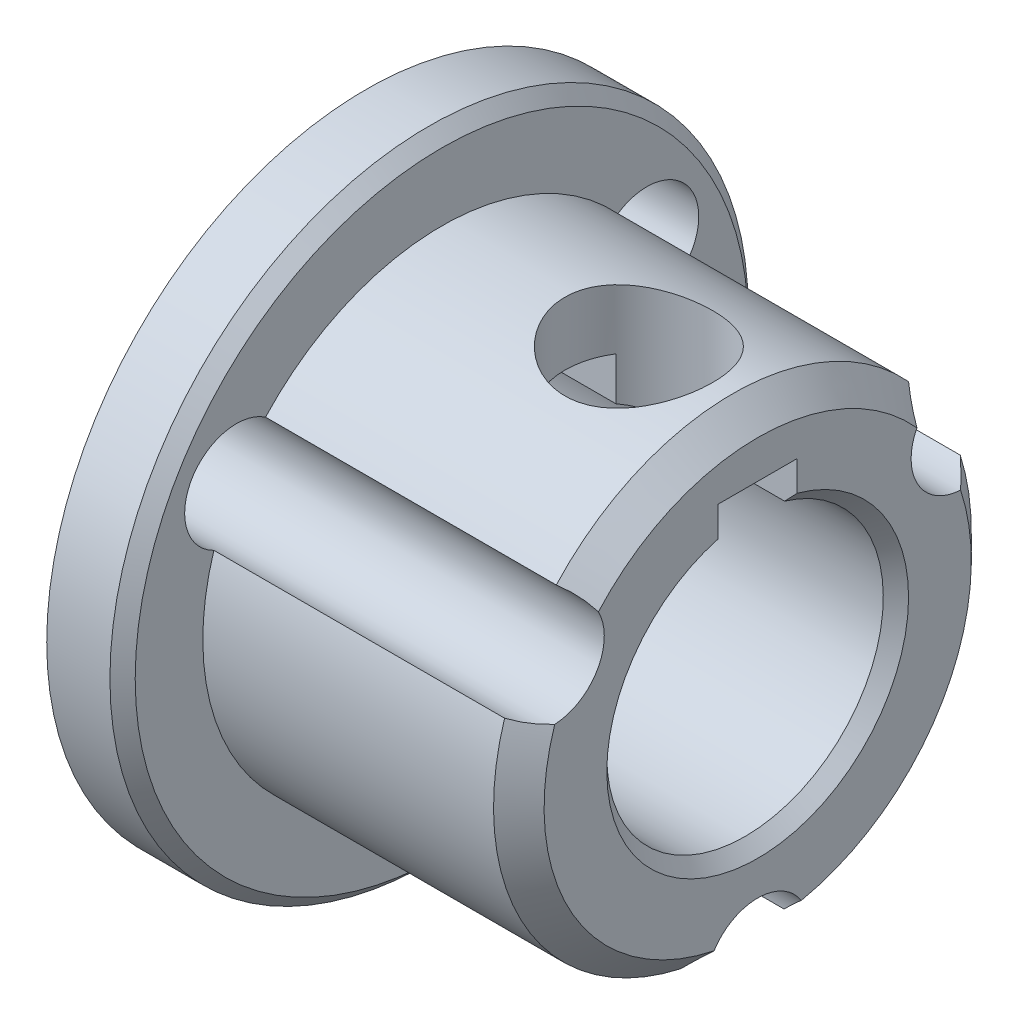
ISO-10303-21;
HEADER;
FILE_DESCRIPTION(('STEP AP214'),'2;1');
FILE_NAME('part.step','',(''),(''),'','','');
FILE_SCHEMA(('AUTOMOTIVE_DESIGN { 1 0 10303 214 1 1 1 1 }'));
ENDSEC;
DATA;
#1=APPLICATION_CONTEXT('core data for automotive mechanical design processes');
#2=APPLICATION_PROTOCOL_DEFINITION('international standard','automotive_design',2000,#1);
#3=PRODUCT_CONTEXT('',#1,'mechanical');
#4=PRODUCT('Part','Part','',(#3));
#5=PRODUCT_RELATED_PRODUCT_CATEGORY('part','',(#4));
#6=PRODUCT_DEFINITION_FORMATION('','',#4);
#7=PRODUCT_DEFINITION_CONTEXT('part definition',#1,'design');
#8=PRODUCT_DEFINITION('design','',#6,#7);
#9=PRODUCT_DEFINITION_SHAPE('','',#8);
#10=(LENGTH_UNIT() NAMED_UNIT(*) SI_UNIT(.MILLI.,.METRE.));
#11=(NAMED_UNIT(*) PLANE_ANGLE_UNIT() SI_UNIT($,.RADIAN.));
#12=(NAMED_UNIT(*) SI_UNIT($,.STERADIAN.) SOLID_ANGLE_UNIT());
#13=UNCERTAINTY_MEASURE_WITH_UNIT(LENGTH_MEASURE(1.E-05),#10,'distance_accuracy_value','');
#14=(GEOMETRIC_REPRESENTATION_CONTEXT(3) GLOBAL_UNCERTAINTY_ASSIGNED_CONTEXT((#13)) GLOBAL_UNIT_ASSIGNED_CONTEXT((#10,
#11,#12)) REPRESENTATION_CONTEXT('',''));
#15=CARTESIAN_POINT('',(0.,0.,0.));
#16=DIRECTION('',(0.,0.,1.));
#17=DIRECTION('',(1.,0.,0.));
#18=AXIS2_PLACEMENT_3D('',#15,#16,#17);
#19=CARTESIAN_POINT('',(0.,0.,0.));
#20=DIRECTION('',(-1.,0.,0.));
#21=DIRECTION('',(0.,0.,1.));
#22=AXIS2_PLACEMENT_3D('',#19,#20,#21);
#23=CYLINDRICAL_SURFACE('',#22,9.6012);
#24=CARTESIAN_POINT('',(7.92480000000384,9.12970132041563,-2.97180000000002));
#25=CARTESIAN_POINT('',(7.76222361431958,9.12970249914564,-2.97179866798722));
#26=CARTESIAN_POINT('',(7.59963390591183,9.13409143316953,-2.95841374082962));
#27=CARTESIAN_POINT('',(7.27922554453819,9.15109716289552,-2.90537716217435));
#28=CARTESIAN_POINT('',(7.12140826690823,9.16371630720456,-2.86571801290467));
#29=CARTESIAN_POINT('',(6.8152315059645,9.19561923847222,-2.7616227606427));
#30=CARTESIAN_POINT('',(6.66685605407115,9.21489139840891,-2.69722986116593));
#31=CARTESIAN_POINT('',(6.38297414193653,9.25791282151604,-2.54563862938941));
#32=CARTESIAN_POINT('',(6.24746987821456,9.28166284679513,-2.45843641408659));
#33=CARTESIAN_POINT('',(5.98861063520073,9.33186158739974,-2.26055519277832));
#34=CARTESIAN_POINT('',(5.86575327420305,9.35837058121,-2.14924036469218));
#35=CARTESIAN_POINT('',(5.640117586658,9.41058697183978,-1.90765476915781));
#36=CARTESIAN_POINT('',(5.53734200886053,9.43629425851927,-1.77738141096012));
#37=CARTESIAN_POINT('',(5.35259990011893,9.48469906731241,-1.49800948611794));
#38=CARTESIAN_POINT('',(5.27114460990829,9.5073173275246,-1.34855790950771));
#39=CARTESIAN_POINT('',(5.1347190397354,9.54629257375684,-1.03725757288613));
#40=CARTESIAN_POINT('',(5.0797426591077,9.56265100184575,-0.875411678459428));
#41=CARTESIAN_POINT('',(4.99949343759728,9.58683680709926,-0.5491261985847));
#42=CARTESIAN_POINT('',(4.9733703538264,9.59490785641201,-0.384914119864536));
#43=CARTESIAN_POINT('',(4.94887665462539,9.60246952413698,-0.0542526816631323));
#44=CARTESIAN_POINT('',(4.95049984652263,9.60196205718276,0.112196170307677));
#45=CARTESIAN_POINT('',(4.98089054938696,9.5925941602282,0.436626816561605));
#46=CARTESIAN_POINT('',(5.00873659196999,9.5840172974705,0.594704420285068));
#47=CARTESIAN_POINT('',(5.08927221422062,9.55982207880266,0.903821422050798));
#48=CARTESIAN_POINT('',(5.14196340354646,9.54420326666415,1.05486036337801));
#49=CARTESIAN_POINT('',(5.27129332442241,9.50729569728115,1.34775418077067));
#50=CARTESIAN_POINT('',(5.34821413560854,9.48594061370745,1.48947579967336));
#51=CARTESIAN_POINT('',(5.52359428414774,9.43981416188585,1.75828834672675));
#52=CARTESIAN_POINT('',(5.62205898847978,9.41504194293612,1.88537561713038));
#53=CARTESIAN_POINT('',(5.84247446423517,9.36352500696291,2.12680769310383));
#54=CARTESIAN_POINT('',(5.96522143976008,9.33674105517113,2.24041823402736));
#55=CARTESIAN_POINT('',(6.22827854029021,9.28509698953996,2.44565833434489));
#56=CARTESIAN_POINT('',(6.36859065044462,9.26023709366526,2.53728540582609));
#57=CARTESIAN_POINT('',(6.66483543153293,9.21506043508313,2.69679029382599));
#58=CARTESIAN_POINT('',(6.8209202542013,9.19479556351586,2.76440130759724));
#59=CARTESIAN_POINT('',(7.14303702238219,9.16171372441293,2.87215193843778));
#60=CARTESIAN_POINT('',(7.30906545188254,9.14889414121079,2.91230120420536));
#61=CARTESIAN_POINT('',(7.63933285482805,9.13273338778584,2.96258274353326));
#62=CARTESIAN_POINT('',(7.80338372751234,9.12903801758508,2.97383742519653));
#63=CARTESIAN_POINT('',(8.13103959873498,9.13056164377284,2.96915727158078));
#64=CARTESIAN_POINT('',(8.29464466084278,9.13577929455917,2.95322654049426));
#65=CARTESIAN_POINT('',(8.61196912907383,9.15419186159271,2.89563003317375));
#66=CARTESIAN_POINT('',(8.76583720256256,9.16715770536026,2.85470253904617));
#67=CARTESIAN_POINT('',(9.06450677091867,9.19936432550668,2.74913848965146));
#68=CARTESIAN_POINT('',(9.20930680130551,9.21860611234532,2.68449811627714));
#69=CARTESIAN_POINT('',(9.49025461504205,9.26187138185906,2.53125886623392));
#70=CARTESIAN_POINT('',(9.62604256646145,9.28601455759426,2.44203493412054));
#71=CARTESIAN_POINT('',(9.88112787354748,9.33611223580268,2.24289403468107));
#72=CARTESIAN_POINT('',(10.0004210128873,9.36206719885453,2.13297179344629));
#73=CARTESIAN_POINT('',(10.2241180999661,9.4141373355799,1.89025215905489));
#74=CARTESIAN_POINT('',(10.3277223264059,9.44021634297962,1.75670803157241));
#75=CARTESIAN_POINT('',(10.5110790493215,9.48854260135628,1.47350103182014));
#76=CARTESIAN_POINT('',(10.5908326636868,9.51079003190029,1.3238389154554));
#77=CARTESIAN_POINT('',(10.7234572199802,9.54881700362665,1.0135842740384));
#78=CARTESIAN_POINT('',(10.7765245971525,9.56464363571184,0.853081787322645));
#79=CARTESIAN_POINT('',(10.8547421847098,9.58825315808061,0.524855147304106));
#80=CARTESIAN_POINT('',(10.8799009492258,9.59603851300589,0.3571332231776));
#81=CARTESIAN_POINT('',(10.9009028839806,9.6025281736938,0.026597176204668));
#82=CARTESIAN_POINT('',(10.8979022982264,9.60159066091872,-0.136137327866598));
#83=CARTESIAN_POINT('',(10.8654590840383,9.59159454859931,-0.458679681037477));
#84=CARTESIAN_POINT('',(10.8360181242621,9.58253646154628,-0.618487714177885));
#85=CARTESIAN_POINT('',(10.7522612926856,9.55742763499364,-0.928749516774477));
#86=CARTESIAN_POINT('',(10.6982499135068,9.54146260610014,-1.07929290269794));
#87=CARTESIAN_POINT('',(10.5671597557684,9.50418726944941,-1.36925495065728));
#88=CARTESIAN_POINT('',(10.490077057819,9.48287605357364,-1.50867171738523));
#89=CARTESIAN_POINT('',(10.3120469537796,9.43624844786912,-1.77749855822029));
#90=CARTESIAN_POINT('',(10.210387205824,9.41082188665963,-1.90641758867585));
#91=CARTESIAN_POINT('',(9.9873514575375,9.35915666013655,-2.14575110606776));
#92=CARTESIAN_POINT('',(9.86596961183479,9.33291775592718,-2.25616008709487));
#93=CARTESIAN_POINT('',(9.60223165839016,9.2815939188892,-2.45893623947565));
#94=CARTESIAN_POINT('',(9.45932446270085,9.25657368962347,-2.55060498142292));
#95=CARTESIAN_POINT('',(9.15938582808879,9.21160858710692,-2.7085212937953));
#96=CARTESIAN_POINT('',(9.0023604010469,9.19166156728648,-2.77477962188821));
#97=CARTESIAN_POINT('',(8.69330031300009,9.16081814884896,-2.87488209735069));
#98=CARTESIAN_POINT('',(8.54210481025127,9.14926494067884,-2.91112118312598));
#99=CARTESIAN_POINT('',(8.23554293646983,9.13370684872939,-2.9595779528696));
#100=CARTESIAN_POINT('',(8.08017755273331,9.12970019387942,-2.97180127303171));
#101=CARTESIAN_POINT('',(7.92480000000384,9.12970132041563,-2.97180000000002));
#102=B_SPLINE_CURVE_WITH_KNOTS('',3,(#24,#25,#26,#27,#28,#29,#30,#31,#32,#33,#34,#35,#36,#37,
#38,#39,#40,#41,#42,#43,#44,#45,#46,#47,#48,#49,#50,#51,#52,#53,#54,#55,#56,#57,#58,#59,#60,#61,
#62,#63,#64,#65,#66,#67,#68,#69,#70,#71,#72,#73,#74,#75,#76,#77,#78,#79,#80,#81,#82,#83,#84,#85,
#86,#87,#88,#89,#90,#91,#92,#93,#94,#95,#96,#97,#98,#99,#100,#101),.UNSPECIFIED.,.T.,.F.,(4,2,2,
2,2,2,2,2,2,2,2,2,2,2,2,2,2,2,2,2,2,2,2,2,2,2,2,2,2,2,2,2,2,2,2,2,2,2,4),(0.,0.487155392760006,
0.974449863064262,1.46089699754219,1.94742699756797,2.4488202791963,2.95028214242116,
3.46284933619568,3.97529837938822,4.47220663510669,4.96900398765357,5.44897065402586,
5.92896842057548,6.41477477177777,6.90070228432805,7.40651483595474,7.91238460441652,
8.42371036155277,8.93485637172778,9.42582392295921,9.91671735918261,10.393769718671,
10.8708989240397,11.3615026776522,11.8522316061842,12.3628558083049,12.8734560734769,
13.3802407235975,13.8868699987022,14.3727907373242,14.8586808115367,15.3387068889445,
15.8188145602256,16.3149899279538,16.8113126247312,17.3236762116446,17.835822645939,
18.301516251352,18.7671005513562),.UNSPECIFIED.);
#103=CARTESIAN_POINT('',(7.92480000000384,9.12970132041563,-2.97180000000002));
#104=VERTEX_POINT('',#103);
#105=EDGE_CURVE('E236',#104,#104,#102,.T.);
#106=ORIENTED_EDGE('',*,*,#105,.F.);
#107=EDGE_LOOP('',(#106));
#108=FACE_BOUND('',#107,.T.);
#109=CARTESIAN_POINT('',(0.,0.,0.));
#110=DIRECTION('',(-1.,0.,0.));
#111=DIRECTION('',(0.,0.,1.));
#112=AXIS2_PLACEMENT_3D('',#109,#110,#111);
#113=CIRCLE('',#112,9.6012);
#114=CARTESIAN_POINT('',(0.,6.48589029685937,7.07928446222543));
#115=VERTEX_POINT('',#114);
#116=CARTESIAN_POINT('',(8.88178419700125E-13,6.48589029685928,-7.0792844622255));
#117=VERTEX_POINT('',#116);
#118=EDGE_CURVE('E289',#115,#117,#113,.T.);
#119=ORIENTED_EDGE('',*,*,#118,.F.);
#120=DIRECTION('',(-1.,0.,0.));
#121=VECTOR('',#120,1.);
#122=CARTESIAN_POINT('',(4.82600000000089,6.48589029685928,7.07928446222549));
#123=LINE('',#122,#121);
#124=CARTESIAN_POINT('',(11.683999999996,6.48589029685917,7.07928446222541));
#125=VERTEX_POINT('',#124);
#126=EDGE_CURVE('E467',#115,#125,#123,.F.);
#127=ORIENTED_EDGE('',*,*,#126,.T.);
#128=CARTESIAN_POINT('',(11.684,0.,0.));
#129=DIRECTION('',(-1.,0.,0.));
#130=DIRECTION('',(0.,0.,1.));
#131=AXIS2_PLACEMENT_3D('',#128,#129,#130);
#132=CIRCLE('',#131,9.6012);
#133=CARTESIAN_POINT('',(11.684,6.48589029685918,-7.07928446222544));
#134=VERTEX_POINT('',#133);
#135=EDGE_CURVE('E61',#125,#134,#132,.T.);
#136=ORIENTED_EDGE('',*,*,#135,.T.);
#137=DIRECTION('',(-1.,0.,0.));
#138=VECTOR('',#137,1.);
#139=CARTESIAN_POINT('',(4.825999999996,6.48589029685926,-7.07928446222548));
#140=LINE('',#139,#138);
#141=EDGE_CURVE('E463',#134,#117,#140,.T.);
#142=ORIENTED_EDGE('',*,*,#141,.T.);
#143=EDGE_LOOP('',(#119,#127,#136,#142));
#144=FACE_BOUND('',#143,.T.);
#145=ADVANCED_FACE('F32',(#108,#144),#23,.T.);
#146=CARTESIAN_POINT('',(11.684,0.,0.));
#147=DIRECTION('',(-1.,0.,0.));
#148=DIRECTION('',(0.,0.,1.));
#149=AXIS2_PLACEMENT_3D('',#146,#147,#148);
#150=CONICAL_SURFACE('',#149,9.6012,0.785398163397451);
#151=CARTESIAN_POINT('',(12.7001999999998,5.72186332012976,6.40019571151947));
#152=CARTESIAN_POINT('',(12.6173534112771,5.80045367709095,6.44102688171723));
#153=CARTESIAN_POINT('',(12.5334264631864,5.87552135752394,6.48629780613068));
#154=CARTESIAN_POINT('',(12.364889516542,6.01784907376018,6.584673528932));
#155=CARTESIAN_POINT('',(12.2802898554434,6.08516511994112,6.63771488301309));
#156=CARTESIAN_POINT('',(12.1105821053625,6.21244659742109,6.75123525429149));
#157=CARTESIAN_POINT('',(12.0254740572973,6.27241261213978,6.81171368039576));
#158=CARTESIAN_POINT('',(11.8547144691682,6.38501480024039,6.94014201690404));
#159=CARTESIAN_POINT('',(11.7690638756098,6.43759007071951,7.00814658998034));
#160=CARTESIAN_POINT('',(11.6837999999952,6.48600379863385,7.07945172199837));
#161=B_SPLINE_CURVE_WITH_KNOTS('',3,(#151,#152,#153,#154,#155,#156,#157,#158,#159,#160),
.UNSPECIFIED.,.F.,.F.,(4,2,2,2,4),(0.,0.36360895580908,0.724399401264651,1.08516118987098,
1.44874049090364),.UNSPECIFIED.);
#162=CARTESIAN_POINT('',(12.7000000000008,5.72205317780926,6.40029424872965));
#163=VERTEX_POINT('',#162);
#164=EDGE_CURVE('E11',#163,#125,#161,.T.);
#165=ORIENTED_EDGE('',*,*,#164,.F.);
#166=CARTESIAN_POINT('',(12.6999999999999,0.,0.));
#167=DIRECTION('',(-1.,0.,0.));
#168=DIRECTION('',(0.,0.,1.));
#169=AXIS2_PLACEMENT_3D('',#166,#167,#168);
#170=CIRCLE('',#169,8.5852);
#171=CARTESIAN_POINT('',(12.6999999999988,5.7220531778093,-6.40029424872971));
#172=VERTEX_POINT('',#171);
#173=EDGE_CURVE('E181',#172,#163,#170,.F.);
#174=ORIENTED_EDGE('',*,*,#173,.F.);
#175=CARTESIAN_POINT('',(11.6838000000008,6.48600379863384,-7.07945172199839));
#176=CARTESIAN_POINT('',(11.7690638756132,6.4375900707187,-7.00814658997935));
#177=CARTESIAN_POINT('',(11.8547144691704,6.38501480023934,-6.94014201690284));
#178=CARTESIAN_POINT('',(12.025474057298,6.27241261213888,-6.81171368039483));
#179=CARTESIAN_POINT('',(12.1105821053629,6.21244659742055,-6.75123525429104));
#180=CARTESIAN_POINT('',(12.2802898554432,6.08516511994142,-6.63771488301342));
#181=CARTESIAN_POINT('',(12.3648895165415,6.01784907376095,-6.58467352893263));
#182=CARTESIAN_POINT('',(12.5334264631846,5.87552135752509,-6.48629780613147));
#183=CARTESIAN_POINT('',(12.6173534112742,5.80045367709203,-6.44102688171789));
#184=CARTESIAN_POINT('',(12.7001999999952,5.72186332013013,-6.40019571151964));
#185=B_SPLINE_CURVE_WITH_KNOTS('',3,(#175,#176,#177,#178,#179,#180,#181,#182,#183,#184),
.UNSPECIFIED.,.F.,.F.,(4,2,2,2,4),(0.,0.363579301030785,0.724341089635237,1.08513153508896,
1.4487404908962),.UNSPECIFIED.);
#186=EDGE_CURVE('E489',#134,#172,#185,.T.);
#187=ORIENTED_EDGE('',*,*,#186,.F.);
#188=ORIENTED_EDGE('',*,*,#135,.F.);
#189=EDGE_LOOP('',(#165,#174,#187,#188));
#190=FACE_BOUND('',#189,.T.);
#191=ADVANCED_FACE('F179',(#190),#150,.T.);
#192=CARTESIAN_POINT('',(-4.88498130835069E-12,2.88789503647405,-9.15658799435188));
#193=VERTEX_POINT('',#192);
#194=CARTESIAN_POINT('',(-4.88498130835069E-12,-9.37378533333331,-2.07730353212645));
#195=VERTEX_POINT('',#194);
#196=EDGE_CURVE('E280',#193,#195,#113,.T.);
#197=ORIENTED_EDGE('',*,*,#196,.F.);
#198=DIRECTION('',(-1.,0.,0.));
#199=VECTOR('',#198,1.);
#200=CARTESIAN_POINT('',(4.826,2.88789503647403,-9.15658799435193));
#201=LINE('',#200,#199);
#202=CARTESIAN_POINT('',(11.683999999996,2.88789503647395,-9.15658799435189));
#203=VERTEX_POINT('',#202);
#204=EDGE_CURVE('E281',#193,#203,#201,.F.);
#205=ORIENTED_EDGE('',*,*,#204,.T.);
#206=CARTESIAN_POINT('',(11.683999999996,-9.37378533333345,-2.07730353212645));
#207=VERTEX_POINT('',#206);
#208=EDGE_CURVE('E500',#203,#207,#132,.T.);
#209=ORIENTED_EDGE('',*,*,#208,.T.);
#210=DIRECTION('',(-1.,0.,0.));
#211=VECTOR('',#210,1.);
#212=CARTESIAN_POINT('',(4.825999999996,-9.37378533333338,-2.07730353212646));
#213=LINE('',#212,#211);
#214=EDGE_CURVE('E284',#207,#195,#213,.T.);
#215=ORIENTED_EDGE('',*,*,#214,.T.);
#216=EDGE_LOOP('',(#197,#205,#209,#215));
#217=FACE_BOUND('',#216,.T.);
#218=ADVANCED_FACE('F254',(#217),#23,.T.);
#219=CARTESIAN_POINT('',(12.7001999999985,2.68180041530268,-8.15537684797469));
#220=CARTESIAN_POINT('',(12.6173534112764,2.67786606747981,-8.24385367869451));
#221=CARTESIAN_POINT('',(12.5334264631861,2.67953799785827,-8.33149965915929));
#222=CARTESIAN_POINT('',(12.3648895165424,2.69357001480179,-8.50394693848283));
#223=CARTESIAN_POINT('',(12.280289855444,2.70584715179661,-8.58876502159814));
#224=CARTESIAN_POINT('',(12.1105821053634,2.74051793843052,-8.75575420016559));
#225=CARTESIAN_POINT('',(12.0254740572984,2.76291078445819,-8.83792550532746));
#226=CARTESIAN_POINT('',(11.8547144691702,2.81783189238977,-8.99965602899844));
#227=CARTESIAN_POINT('',(11.7690638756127,2.85043794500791,-9.07918983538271));
#228=CARTESIAN_POINT('',(11.6837999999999,2.88798313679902,-9.15676991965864));
#229=B_SPLINE_CURVE_WITH_KNOTS('',3,(#219,#220,#221,#222,#223,#224,#225,#226,#227,#228),
.UNSPECIFIED.,.F.,.F.,(4,2,2,2,4),(0.,0.363608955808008,0.724399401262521,1.0851611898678,
1.4487404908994),.UNSPECIFIED.);
#230=CARTESIAN_POINT('',(12.7000000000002,2.68179082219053,-8.15559053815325));
#231=VERTEX_POINT('',#230);
#232=EDGE_CURVE('E484',#231,#203,#229,.T.);
#233=ORIENTED_EDGE('',*,*,#232,.F.);
#234=CARTESIAN_POINT('',(12.6999999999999,-8.40384400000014,-1.75529628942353));
#235=VERTEX_POINT('',#234);
#236=EDGE_CURVE('E187',#235,#231,#170,.F.);
#237=ORIENTED_EDGE('',*,*,#236,.F.);
#238=CARTESIAN_POINT('',(11.6837999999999,-9.37398693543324,-2.07731819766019));
#239=CARTESIAN_POINT('',(11.7690638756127,-9.28802801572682,-2.07104324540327));
#240=CARTESIAN_POINT('',(11.8547144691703,-9.20284669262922,-2.05951401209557));
#241=CARTESIAN_POINT('',(12.0254740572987,-9.03532339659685,-2.02621182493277));
#242=CARTESIAN_POINT('',(12.1105821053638,-8.95296453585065,-2.00451894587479));
#243=CARTESIAN_POINT('',(12.2802898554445,-8.79101227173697,-1.9510501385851));
#244=CARTESIAN_POINT('',(12.3648895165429,-8.71141908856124,-1.9192734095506));
#245=CARTESIAN_POINT('',(12.5334264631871,-8.55505935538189,-1.84520185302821));
#246=CARTESIAN_POINT('',(12.6173534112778,-8.47831974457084,-1.80282679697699));
#247=CARTESIAN_POINT('',(12.7002000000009,-8.40366373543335,-1.75518113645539));
#248=B_SPLINE_CURVE_WITH_KNOTS('',3,(#238,#239,#240,#241,#242,#243,#244,#245,#246,#247),
.UNSPECIFIED.,.F.,.F.,(4,2,2,2,4),(0.,0.363579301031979,0.724341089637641,1.08513153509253,
1.44874049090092),.UNSPECIFIED.);
#249=EDGE_CURVE('E198',#207,#235,#248,.T.);
#250=ORIENTED_EDGE('',*,*,#249,.F.);
#251=ORIENTED_EDGE('',*,*,#208,.F.);
#252=EDGE_LOOP('',(#233,#237,#250,#251));
#253=FACE_BOUND('',#252,.T.);
#254=ADVANCED_FACE('F260',(#253),#150,.T.);
#255=CARTESIAN_POINT('',(0.,0.,0.));
#256=DIRECTION('',(-1.,0.,0.));
#257=DIRECTION('',(0.,0.,1.));
#258=AXIS2_PLACEMENT_3D('',#255,#256,#257);
#259=CYLINDRICAL_SURFACE('',#258,5.55625);
#260=CARTESIAN_POINT('',(7.92480000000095,4.69471179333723,-2.97180000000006));
#261=CARTESIAN_POINT('',(8.00138996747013,4.69471194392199,-2.97179978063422));
#262=CARTESIAN_POINT('',(8.07797817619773,4.69659435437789,-2.96883342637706));
#263=CARTESIAN_POINT('',(8.2305286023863,4.70403704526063,-2.95702394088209));
#264=CARTESIAN_POINT('',(8.30649057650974,4.70959869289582,-2.94817862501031));
#265=CARTESIAN_POINT('',(8.53271048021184,4.73153794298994,-2.91295125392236));
#266=CARTESIAN_POINT('',(8.68121050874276,4.75316948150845,-2.87787796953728));
#267=CARTESIAN_POINT('',(8.96828855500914,4.80721298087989,-2.78663826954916));
#268=CARTESIAN_POINT('',(9.10691977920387,4.83956080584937,-2.73059709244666));
#269=CARTESIAN_POINT('',(9.37279923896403,4.91127512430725,-2.59939867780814));
#270=CARTESIAN_POINT('',(9.50004557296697,4.95064278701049,-2.524238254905));
#271=CARTESIAN_POINT('',(9.75284388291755,5.03652563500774,-2.34856367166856));
#272=CARTESIAN_POINT('',(9.87708178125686,5.08336447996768,-2.24631721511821));
#273=CARTESIAN_POINT('',(10.1076925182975,5.17631104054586,-2.02295842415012));
#274=CARTESIAN_POINT('',(10.2140552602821,5.22241832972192,-1.90183550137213));
#275=CARTESIAN_POINT('',(10.4142461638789,5.31310322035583,-1.6323626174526));
#276=CARTESIAN_POINT('',(10.5063935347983,5.35726417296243,-1.48261039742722));
#277=CARTESIAN_POINT('',(10.6635790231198,5.43475322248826,-1.16692105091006));
#278=CARTESIAN_POINT('',(10.7286366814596,5.46808912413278,-1.00099569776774));
#279=CARTESIAN_POINT('',(10.8243728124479,5.51781742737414,-0.671637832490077));
#280=CARTESIAN_POINT('',(10.8573733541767,5.53534619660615,-0.509055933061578));
#281=CARTESIAN_POINT('',(10.8957731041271,5.5557825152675,-0.179798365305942));
#282=CARTESIAN_POINT('',(10.9011918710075,5.55870042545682,-0.0131256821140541));
#283=CARTESIAN_POINT('',(10.8850138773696,5.55005997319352,0.301839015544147));
#284=CARTESIAN_POINT('',(10.866043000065,5.53990855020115,0.450314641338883));
#285=CARTESIAN_POINT('',(10.8064187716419,5.50848474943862,0.741600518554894));
#286=CARTESIAN_POINT('',(10.7657637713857,5.48721152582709,0.88441033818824));
#287=CARTESIAN_POINT('',(10.6638344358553,5.4351350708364,1.16253969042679));
#288=CARTESIAN_POINT('',(10.6023207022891,5.404221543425,1.29774998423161));
#289=CARTESIAN_POINT('',(10.4608448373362,5.33554292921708,1.55621486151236));
#290=CARTESIAN_POINT('',(10.3808765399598,5.29777555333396,1.67946542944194));
#291=CARTESIAN_POINT('',(10.1952576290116,5.21418589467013,1.92421115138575));
#292=CARTESIAN_POINT('',(10.0878013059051,5.16793440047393,2.04419161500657));
#293=CARTESIAN_POINT('',(9.85505097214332,5.07491625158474,2.26529406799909));
#294=CARTESIAN_POINT('',(9.72974004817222,5.0281491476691,2.36639796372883));
#295=CARTESIAN_POINT('',(9.45254193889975,4.93518144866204,2.55496019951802));
#296=CARTESIAN_POINT('',(9.29933054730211,4.88932560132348,2.64067939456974));
#297=CARTESIAN_POINT('',(9.05836399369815,4.82899766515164,2.74852624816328));
#298=CARTESIAN_POINT('',(8.97616791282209,4.81029507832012,2.78102382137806));
#299=CARTESIAN_POINT('',(8.8085639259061,4.77646717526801,2.83873113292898));
#300=CARTESIAN_POINT('',(8.72315817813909,4.76133950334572,2.86394567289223));
#301=CARTESIAN_POINT('',(8.55680323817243,4.73640558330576,2.90497956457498));
#302=CARTESIAN_POINT('',(8.47604958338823,4.72626873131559,2.92139231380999));
#303=CARTESIAN_POINT('',(8.31309727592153,4.71004535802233,2.94747748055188));
#304=CARTESIAN_POINT('',(8.23089945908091,4.7039565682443,2.95715367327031));
#305=CARTESIAN_POINT('',(8.06581872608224,4.69610672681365,2.96960482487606));
#306=CARTESIAN_POINT('',(7.98293624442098,4.69434311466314,2.97238386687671));
#307=CARTESIAN_POINT('',(7.81727926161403,4.69521034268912,2.97101096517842));
#308=CARTESIAN_POINT('',(7.73450475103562,4.69784076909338,2.9668596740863));
#309=CARTESIAN_POINT('',(7.50960243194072,4.71089873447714,2.94612304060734));
#310=CARTESIAN_POINT('',(7.36828598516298,4.72561825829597,2.92267008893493));
#311=CARTESIAN_POINT('',(7.09204416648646,4.76602785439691,2.85628399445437));
#312=CARTESIAN_POINT('',(6.95712134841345,4.79172227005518,2.8133431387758));
#313=CARTESIAN_POINT('',(6.69049878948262,4.85244478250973,2.70731839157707));
#314=CARTESIAN_POINT('',(6.5592039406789,4.8878346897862,2.64342932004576));
#315=CARTESIAN_POINT('',(6.30842261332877,4.96373578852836,2.49799221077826));
#316=CARTESIAN_POINT('',(6.18894217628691,5.00424957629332,2.41643520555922));
#317=CARTESIAN_POINT('',(5.94661969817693,5.0930327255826,2.22390474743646));
#318=CARTESIAN_POINT('',(5.82590331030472,5.14156169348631,2.11036308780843));
#319=CARTESIAN_POINT('',(5.60444310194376,5.23586947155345,1.86412791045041));
#320=CARTESIAN_POINT('',(5.50370935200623,5.28164688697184,1.73142479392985));
#321=CARTESIAN_POINT('',(5.32119761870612,5.36771007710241,1.44330173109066));
#322=CARTESIAN_POINT('',(5.24040286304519,5.4076812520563,1.28715782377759));
#323=CARTESIAN_POINT('',(5.10707894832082,5.47508401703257,0.9607471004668));
#324=CARTESIAN_POINT('',(5.05452169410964,5.50252806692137,0.790494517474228));
#325=CARTESIAN_POINT('',(4.98425096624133,5.5395268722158,0.458895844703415));
#326=CARTESIAN_POINT('',(4.96359923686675,5.55058564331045,0.298340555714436));
#327=CARTESIAN_POINT('',(4.94872108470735,5.55853517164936,-0.0243131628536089));
#328=CARTESIAN_POINT('',(4.9544823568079,5.55543252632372,-0.186410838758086));
#329=CARTESIAN_POINT('',(4.99051723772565,5.53625697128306,-0.493473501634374));
#330=CARTESIAN_POINT('',(5.01874556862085,5.52126664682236,-0.638754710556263));
#331=CARTESIAN_POINT('',(5.0958913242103,5.48105479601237,-0.922199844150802));
#332=CARTESIAN_POINT('',(5.14481135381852,5.45583198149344,-1.06036287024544));
#333=CARTESIAN_POINT('',(5.26372475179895,5.39619309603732,-1.33154747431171));
#334=CARTESIAN_POINT('',(5.33443810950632,5.36146836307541,-1.46418326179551));
#335=CARTESIAN_POINT('',(5.49404212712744,5.28620363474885,-1.71618421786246));
#336=CARTESIAN_POINT('',(5.58294058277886,5.24566114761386,-1.83554366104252));
#337=CARTESIAN_POINT('',(5.7877348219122,5.15731665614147,-2.07161418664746));
#338=CARTESIAN_POINT('',(5.90553041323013,5.10920799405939,-2.18656698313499));
#339=CARTESIAN_POINT('',(6.15889077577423,5.01446988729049,-2.39587804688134));
#340=CARTESIAN_POINT('',(6.29447509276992,4.96784214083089,-2.49021335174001));
#341=CARTESIAN_POINT('',(6.58917307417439,4.87888845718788,-2.66047426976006));
#342=CARTESIAN_POINT('',(6.74917109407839,4.83694058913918,-2.73510070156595));
#343=CARTESIAN_POINT('',(6.99879487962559,4.78447126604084,-2.82523387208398));
#344=CARTESIAN_POINT('',(7.0835304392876,4.7687326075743,-2.85163052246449));
#345=CARTESIAN_POINT('',(7.25563332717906,4.74140371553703,-2.8968443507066));
#346=CARTESIAN_POINT('',(7.34299887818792,4.72981074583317,-2.91566652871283));
#347=CARTESIAN_POINT('',(7.51248066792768,4.71209066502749,-2.94421026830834));
#348=CARTESIAN_POINT('',(7.59445717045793,4.70560025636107,-2.95453979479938));
#349=CARTESIAN_POINT('',(7.75922311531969,4.69691066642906,-2.96833489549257));
#350=CARTESIAN_POINT('',(7.84201258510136,4.69471163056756,-2.97180023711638));
#351=CARTESIAN_POINT('',(7.92480000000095,4.69471179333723,-2.97180000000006));
#352=B_SPLINE_CURVE_WITH_KNOTS('',3,(#260,#261,#262,#263,#264,#265,#266,#267,#268,#269,#270,
#271,#272,#273,#274,#275,#276,#277,#278,#279,#280,#281,#282,#283,#284,#285,#286,#287,#288,#289,
#290,#291,#292,#293,#294,#295,#296,#297,#298,#299,#300,#301,#302,#303,#304,#305,#306,#307,#308,
#309,#310,#311,#312,#313,#314,#315,#316,#317,#318,#319,#320,#321,#322,#323,#324,#325,#326,#327,
#328,#329,#330,#331,#332,#333,#334,#335,#336,#337,#338,#339,#340,#341,#342,#343,#344,#345,#346,
#347,#348,#349,#350,#351),.UNSPECIFIED.,.T.,.F.,(4,2,2,2,2,2,2,2,2,2,2,2,2,2,2,2,2,2,2,2,2,2,2,
2,2,2,2,2,2,2,2,2,2,2,2,2,2,2,2,2,2,2,2,2,2,4),(0.,0.229678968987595,0.459443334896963,
0.919243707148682,1.37634049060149,1.83351347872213,2.3342011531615,2.83517069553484,
3.37617206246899,3.91678250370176,4.4144120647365,4.9116886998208,5.35964954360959,
5.80764446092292,6.26096562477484,6.71443847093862,7.21505674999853,7.71615244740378,
8.25734311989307,8.52803501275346,8.79854803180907,9.0472603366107,9.29583314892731,
9.54425877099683,9.79266100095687,10.2225128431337,10.6525349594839,11.1015311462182,
11.5507557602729,12.0665507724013,12.5826050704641,13.1205101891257,13.6578791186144,
14.1419641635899,14.6258237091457,15.0700727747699,15.5143777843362,15.9753067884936,
16.4364338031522,16.9486459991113,17.4614257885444,18.0024313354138,18.2724710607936,
18.5423322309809,18.790587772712,19.0388517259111),.UNSPECIFIED.);
#353=CARTESIAN_POINT('',(10.4370577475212,5.32463687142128,1.58749999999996));
#354=VERTEX_POINT('',#353);
#355=CARTESIAN_POINT('',(5.41254225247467,5.32463687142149,1.58749999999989));
#356=VERTEX_POINT('',#355);
#357=EDGE_CURVE('E442',#354,#356,#352,.T.);
#358=ORIENTED_EDGE('',*,*,#357,.F.);
#359=DIRECTION('',(-1.,0.,0.));
#360=VECTOR('',#359,1.);
#361=CARTESIAN_POINT('',(12.6999999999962,5.32463687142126,1.58749999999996));
#362=LINE('',#361,#360);
#363=CARTESIAN_POINT('',(12.192,5.32463687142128,1.5875));
#364=VERTEX_POINT('',#363);
#365=EDGE_CURVE('E356',#364,#354,#362,.T.);
#366=ORIENTED_EDGE('',*,*,#365,.F.);
#367=CARTESIAN_POINT('',(12.1919999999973,-1.07552855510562E-13,0.));
#368=DIRECTION('',(-1.,0.,0.));
#369=DIRECTION('',(0.,0.,1.));
#370=AXIS2_PLACEMENT_3D('',#367,#368,#369);
#371=CIRCLE('',#370,5.55625);
#372=CARTESIAN_POINT('',(12.192,5.32463687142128,-1.5875));
#373=VERTEX_POINT('',#372);
#374=EDGE_CURVE('E298',#364,#373,#371,.F.);
#375=ORIENTED_EDGE('',*,*,#374,.T.);
#376=DIRECTION('',(-1.,0.,0.));
#377=VECTOR('',#376,1.);
#378=CARTESIAN_POINT('',(12.699999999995,5.32463687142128,-1.58750000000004));
#379=LINE('',#378,#377);
#380=CARTESIAN_POINT('',(10.4370577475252,5.3246368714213,-1.5875));
#381=VERTEX_POINT('',#380);
#382=EDGE_CURVE('E355',#373,#381,#379,.T.);
#383=ORIENTED_EDGE('',*,*,#382,.T.);
#384=CARTESIAN_POINT('',(5.41254225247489,5.32463687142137,-1.5875));
#385=VERTEX_POINT('',#384);
#386=EDGE_CURVE('E229',#385,#381,#352,.T.);
#387=ORIENTED_EDGE('',*,*,#386,.F.);
#388=CARTESIAN_POINT('',(-2.54000000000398,5.3246368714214,-1.58750000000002));
#389=VERTEX_POINT('',#388);
#390=EDGE_CURVE('E409',#385,#389,#379,.T.);
#391=ORIENTED_EDGE('',*,*,#390,.T.);
#392=CARTESIAN_POINT('',(-2.53999999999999,0.,0.));
#393=DIRECTION('',(1.,0.,0.));
#394=DIRECTION('',(0.,0.,-1.));
#395=AXIS2_PLACEMENT_3D('',#392,#393,#394);
#396=CIRCLE('',#395,5.55625);
#397=CARTESIAN_POINT('',(-2.53999999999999,5.32463687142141,1.58749999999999));
#398=VERTEX_POINT('',#397);
#399=EDGE_CURVE('E302',#389,#398,#396,.F.);
#400=ORIENTED_EDGE('',*,*,#399,.T.);
#401=EDGE_CURVE('E425',#356,#398,#362,.T.);
#402=ORIENTED_EDGE('',*,*,#401,.F.);
#403=EDGE_LOOP('',(#358,#366,#375,#383,#387,#391,#400,#402));
#404=FACE_BOUND('',#403,.T.);
#405=ADVANCED_FACE('F252',(#404),#259,.F.);
#406=CARTESIAN_POINT('',(11.684,-9.37378533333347,2.07730353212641));
#407=VERTEX_POINT('',#406);
#408=CARTESIAN_POINT('',(11.684,2.88789503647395,9.15658799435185));
#409=VERTEX_POINT('',#408);
#410=EDGE_CURVE('E191',#407,#409,#132,.T.);
#411=ORIENTED_EDGE('',*,*,#410,.T.);
#412=DIRECTION('',(-1.,0.,0.));
#413=VECTOR('',#412,1.);
#414=CARTESIAN_POINT('',(4.825999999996,2.88789503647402,9.15658799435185));
#415=LINE('',#414,#413);
#416=CARTESIAN_POINT('',(0.,2.88789503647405,9.15658799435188));
#417=VERTEX_POINT('',#416);
#418=EDGE_CURVE('E53',#409,#417,#415,.T.);
#419=ORIENTED_EDGE('',*,*,#418,.T.);
#420=CARTESIAN_POINT('',(0.,-9.37378533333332,2.07730353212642));
#421=VERTEX_POINT('',#420);
#422=EDGE_CURVE('E292',#421,#417,#113,.T.);
#423=ORIENTED_EDGE('',*,*,#422,.F.);
#424=DIRECTION('',(-1.,0.,0.));
#425=VECTOR('',#424,1.);
#426=CARTESIAN_POINT('',(4.82600000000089,-9.37378533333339,2.07730353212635));
#427=LINE('',#426,#425);
#428=EDGE_CURVE('E448',#421,#407,#427,.F.);
#429=ORIENTED_EDGE('',*,*,#428,.T.);
#430=EDGE_LOOP('',(#411,#419,#423,#429));
#431=FACE_BOUND('',#430,.T.);
#432=ADVANCED_FACE('F246',(#431),#23,.T.);
#433=CARTESIAN_POINT('',(12.699999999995,5.32463687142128,-1.58750000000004));
#434=DIRECTION('',(0.,0.,-1.));
#435=DIRECTION('',(-1.,0.,0.));
#436=AXIS2_PLACEMENT_3D('',#433,#434,#435);
#437=PLANE('',#436);
#438=DIRECTION('',(0.,-1.,0.));
#439=VECTOR('',#438,1.);
#440=CARTESIAN_POINT('',(10.4370577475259,12.8269999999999,-1.5875));
#441=LINE('',#440,#439);
#442=CARTESIAN_POINT('',(10.4370577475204,7.06119999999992,-1.58750000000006));
#443=VERTEX_POINT('',#442);
#444=EDGE_CURVE('E445',#381,#443,#441,.F.);
#445=ORIENTED_EDGE('',*,*,#444,.F.);
#446=ORIENTED_EDGE('',*,*,#382,.F.);
#447=CARTESIAN_POINT('',(11.1104289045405,4.18361028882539,-1.58750000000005));
#448=CARTESIAN_POINT('',(11.2087118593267,4.28872438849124,-1.58750000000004));
#449=CARTESIAN_POINT('',(11.307236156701,4.39361213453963,-1.58750000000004));
#450=CARTESIAN_POINT('',(11.5046901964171,4.60300445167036,-1.58750000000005));
#451=CARTESIAN_POINT('',(11.6036199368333,4.707509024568,-1.58750000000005));
#452=CARTESIAN_POINT('',(11.9008984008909,5.02054907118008,-1.58750000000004));
#453=CARTESIAN_POINT('',(12.0997408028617,5.22861560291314,-1.5875));
#454=CARTESIAN_POINT('',(12.4983402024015,5.64386397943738,-1.5875));
#455=CARTESIAN_POINT('',(12.6980971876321,5.85104583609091,-1.58750000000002));
#456=CARTESIAN_POINT('',(13.0983029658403,6.26474959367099,-1.58750000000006));
#457=CARTESIAN_POINT('',(13.2987517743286,6.47127147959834,-1.58750000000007));
#458=CARTESIAN_POINT('',(13.4994292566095,6.67756966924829,-1.58750000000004));
#459=B_SPLINE_CURVE_WITH_KNOTS('',3,(#447,#448,#449,#450,#451,#452,#453,#454,#455,#456,#457,
#458),.UNSPECIFIED.,.F.,.F.,(4,2,2,2,2,4),(0.,0.431712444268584,0.86342284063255,
1.72682418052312,2.59021390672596,3.45362311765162),.UNSPECIFIED.);
#460=CARTESIAN_POINT('',(12.699999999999,5.85277471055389,-1.58750000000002));
#461=VERTEX_POINT('',#460);
#462=EDGE_CURVE('E328',#373,#461,#459,.T.);
#463=ORIENTED_EDGE('',*,*,#462,.T.);
#464=DIRECTION('',(0.,-1.,0.));
#465=VECTOR('',#464,1.);
#466=CARTESIAN_POINT('',(12.699999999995,5.32463687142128,-1.58750000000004));
#467=LINE('',#466,#465);
#468=CARTESIAN_POINT('',(12.6999999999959,7.06119999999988,-1.58750000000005));
#469=VERTEX_POINT('',#468);
#470=EDGE_CURVE('E422',#469,#461,#467,.T.);
#471=ORIENTED_EDGE('',*,*,#470,.F.);
#472=DIRECTION('',(-1.,0.,0.));
#473=VECTOR('',#472,1.);
#474=CARTESIAN_POINT('',(12.6999999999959,7.06119999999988,-1.58750000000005));
#475=LINE('',#474,#473);
#476=EDGE_CURVE('E427',#469,#443,#475,.T.);
#477=ORIENTED_EDGE('',*,*,#476,.T.);
#478=EDGE_LOOP('',(#445,#446,#463,#471,#477));
#479=FACE_BOUND('',#478,.T.);
#480=ADVANCED_FACE('F251',(#479),#437,.F.);
#481=DIRECTION('',(0.,-1.,0.));
#482=VECTOR('',#481,1.);
#483=CARTESIAN_POINT('',(5.41254225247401,12.8269999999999,-1.58750000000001));
#484=LINE('',#483,#482);
#485=CARTESIAN_POINT('',(5.41254225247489,7.0612,-1.58750000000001));
#486=VERTEX_POINT('',#485);
#487=EDGE_CURVE('E244',#486,#385,#484,.T.);
#488=ORIENTED_EDGE('',*,*,#487,.F.);
#489=CARTESIAN_POINT('',(-3.04800000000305,7.06120000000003,-1.58750000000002));
#490=VERTEX_POINT('',#489);
#491=EDGE_CURVE('E411',#486,#490,#475,.T.);
#492=ORIENTED_EDGE('',*,*,#491,.T.);
#493=DIRECTION('',(0.,-1.,0.));
#494=VECTOR('',#493,1.);
#495=CARTESIAN_POINT('',(-3.04799999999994,5.32463687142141,-1.58749999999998));
#496=LINE('',#495,#494);
#497=CARTESIAN_POINT('',(-3.04800000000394,5.85277471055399,-1.5875));
#498=VERTEX_POINT('',#497);
#499=EDGE_CURVE('E399',#490,#498,#496,.T.);
#500=ORIENTED_EDGE('',*,*,#499,.T.);
#501=CARTESIAN_POINT('',(-4.06326446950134,6.89922958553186,-1.58750000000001));
#502=CARTESIAN_POINT('',(-3.86240857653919,6.6931064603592,-1.58750000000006));
#503=CARTESIAN_POINT('',(-3.66176577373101,6.48677490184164,-1.58750000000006));
#504=CARTESIAN_POINT('',(-3.26110167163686,6.07351652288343,-1.58750000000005));
#505=CARTESIAN_POINT('',(-3.06108036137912,5.86658971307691,-1.58750000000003));
#506=CARTESIAN_POINT('',(-2.66184538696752,5.45195301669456,-1.58750000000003));
#507=CARTESIAN_POINT('',(-2.46263173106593,5.24424312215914,-1.58750000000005));
#508=CARTESIAN_POINT('',(-2.06538418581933,4.82769171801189,-1.58750000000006));
#509=CARTESIAN_POINT('',(-1.8673503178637,4.61885018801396,-1.58750000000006));
#510=CARTESIAN_POINT('',(-1.67009498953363,4.40927126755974,-1.58750000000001));
#511=B_SPLINE_CURVE_WITH_KNOTS('',3,(#501,#502,#503,#504,#505,#506,#507,#508,#509,#510),
.UNSPECIFIED.,.F.,.F.,(4,2,2,2,4),(0.,0.863405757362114,1.726796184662,2.59019541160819,
3.45361024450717),.UNSPECIFIED.);
#512=EDGE_CURVE('E294',#498,#389,#511,.T.);
#513=ORIENTED_EDGE('',*,*,#512,.T.);
#514=ORIENTED_EDGE('',*,*,#390,.F.);
#515=EDGE_LOOP('',(#488,#492,#500,#513,#514));
#516=FACE_BOUND('',#515,.T.);
#517=ADVANCED_FACE('F408',(#516),#437,.F.);
#518=CARTESIAN_POINT('',(12.6999999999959,7.06119999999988,-1.58750000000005));
#519=DIRECTION('',(0.,1.,0.));
#520=DIRECTION('',(0.,0.,1.));
#521=AXIS2_PLACEMENT_3D('',#518,#519,#520);
#522=PLANE('',#521);
#523=CARTESIAN_POINT('',(7.92479999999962,7.06119999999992,0.));
#524=DIRECTION('',(0.,1.,0.));
#525=DIRECTION('',(0.,0.,1.));
#526=AXIS2_PLACEMENT_3D('',#523,#524,#525);
#527=CIRCLE('',#526,2.9718);
#528=CARTESIAN_POINT('',(5.41254225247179,7.06119999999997,1.58749999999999));
#529=VERTEX_POINT('',#528);
#530=EDGE_CURVE('E446',#529,#486,#527,.F.);
#531=ORIENTED_EDGE('',*,*,#530,.F.);
#532=DIRECTION('',(-1.,0.,0.));
#533=VECTOR('',#532,1.);
#534=CARTESIAN_POINT('',(12.6999999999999,7.06119999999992,1.58750000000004));
#535=LINE('',#534,#533);
#536=CARTESIAN_POINT('',(-3.04799999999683,7.06120000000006,1.58750000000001));
#537=VERTEX_POINT('',#536);
#538=EDGE_CURVE('E431',#529,#537,#535,.T.);
#539=ORIENTED_EDGE('',*,*,#538,.T.);
#540=DIRECTION('',(0.,0.,-1.));
#541=VECTOR('',#540,1.);
#542=CARTESIAN_POINT('',(-3.04800000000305,7.06120000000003,-1.58750000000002));
#543=LINE('',#542,#541);
#544=EDGE_CURVE('E414',#537,#490,#543,.T.);
#545=ORIENTED_EDGE('',*,*,#544,.T.);
#546=ORIENTED_EDGE('',*,*,#491,.F.);
#547=EDGE_LOOP('',(#531,#539,#545,#546));
#548=FACE_BOUND('',#547,.T.);
#549=ADVANCED_FACE('F344',(#548),#522,.F.);
#550=CARTESIAN_POINT('',(10.437057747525,7.06119999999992,1.58749999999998));
#551=VERTEX_POINT('',#550);
#552=EDGE_CURVE('E447',#443,#551,#527,.F.);
#553=ORIENTED_EDGE('',*,*,#552,.F.);
#554=ORIENTED_EDGE('',*,*,#476,.F.);
#555=DIRECTION('',(0.,0.,-1.));
#556=VECTOR('',#555,1.);
#557=CARTESIAN_POINT('',(12.6999999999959,7.06119999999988,-1.58750000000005));
#558=LINE('',#557,#556);
#559=CARTESIAN_POINT('',(12.6999999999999,7.06119999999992,1.58750000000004));
#560=VERTEX_POINT('',#559);
#561=EDGE_CURVE('E417',#560,#469,#558,.T.);
#562=ORIENTED_EDGE('',*,*,#561,.F.);
#563=EDGE_CURVE('E429',#560,#551,#535,.T.);
#564=ORIENTED_EDGE('',*,*,#563,.T.);
#565=EDGE_LOOP('',(#553,#554,#562,#564));
#566=FACE_BOUND('',#565,.T.);
#567=ADVANCED_FACE('F342',(#566),#522,.F.);
#568=CARTESIAN_POINT('',(12.6999999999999,7.06119999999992,1.58750000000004));
#569=DIRECTION('',(0.,0.,1.));
#570=DIRECTION('',(0.,-1.,0.));
#571=AXIS2_PLACEMENT_3D('',#568,#569,#570);
#572=PLANE('',#571);
#573=DIRECTION('',(0.,-1.,0.));
#574=VECTOR('',#573,1.);
#575=CARTESIAN_POINT('',(5.41254225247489,12.8269999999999,1.58749999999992));
#576=LINE('',#575,#574);
#577=EDGE_CURVE('E196',#356,#529,#576,.F.);
#578=ORIENTED_EDGE('',*,*,#577,.F.);
#579=ORIENTED_EDGE('',*,*,#401,.T.);
#580=CARTESIAN_POINT('',(-1.67009498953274,4.40927126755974,1.5875));
#581=CARTESIAN_POINT('',(-1.8673503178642,4.61885018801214,1.58750000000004));
#582=CARTESIAN_POINT('',(-2.06538418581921,4.82769171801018,1.58750000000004));
#583=CARTESIAN_POINT('',(-2.46263173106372,5.24424312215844,1.58750000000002));
#584=CARTESIAN_POINT('',(-2.66184538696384,5.45195301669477,1.5875));
#585=CARTESIAN_POINT('',(-3.06108036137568,5.86658971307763,1.5875));
#586=CARTESIAN_POINT('',(-3.26110167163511,6.07351652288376,1.58750000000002));
#587=CARTESIAN_POINT('',(-3.66176577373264,6.48677490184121,1.58750000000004));
#588=CARTESIAN_POINT('',(-3.86240857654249,6.69310646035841,1.58750000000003));
#589=CARTESIAN_POINT('',(-4.06326446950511,6.89922958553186,1.58749999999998));
#590=B_SPLINE_CURVE_WITH_KNOTS('',3,(#580,#581,#582,#583,#584,#585,#586,#587,#588,#589),
.UNSPECIFIED.,.F.,.F.,(4,2,2,2,4),(0.,0.863414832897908,1.72681405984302,2.5902044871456,
3.45361024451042),.UNSPECIFIED.);
#591=CARTESIAN_POINT('',(-3.04799999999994,5.85277471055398,1.58749999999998));
#592=VERTEX_POINT('',#591);
#593=EDGE_CURVE('E348',#398,#592,#590,.T.);
#594=ORIENTED_EDGE('',*,*,#593,.T.);
#595=DIRECTION('',(0.,1.,0.));
#596=VECTOR('',#595,1.);
#597=CARTESIAN_POINT('',(-3.04799999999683,7.06120000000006,1.58750000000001));
#598=LINE('',#597,#596);
#599=EDGE_CURVE('E243',#592,#537,#598,.T.);
#600=ORIENTED_EDGE('',*,*,#599,.T.);
#601=ORIENTED_EDGE('',*,*,#538,.F.);
#602=EDGE_LOOP('',(#578,#579,#594,#600,#601));
#603=FACE_BOUND('',#602,.T.);
#604=ADVANCED_FACE('F337',(#603),#572,.F.);
#605=DIRECTION('',(0.,-1.,0.));
#606=VECTOR('',#605,1.);
#607=CARTESIAN_POINT('',(10.437057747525,12.8269999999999,1.5875));
#608=LINE('',#607,#606);
#609=EDGE_CURVE('E190',#551,#354,#608,.T.);
#610=ORIENTED_EDGE('',*,*,#609,.F.);
#611=ORIENTED_EDGE('',*,*,#563,.F.);
#612=DIRECTION('',(0.,1.,0.));
#613=VECTOR('',#612,1.);
#614=CARTESIAN_POINT('',(12.6999999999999,7.06119999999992,1.58750000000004));
#615=LINE('',#614,#613);
#616=CARTESIAN_POINT('',(12.699999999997,5.85277471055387,1.58749999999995));
#617=VERTEX_POINT('',#616);
#618=EDGE_CURVE('E413',#617,#560,#615,.T.);
#619=ORIENTED_EDGE('',*,*,#618,.F.);
#620=CARTESIAN_POINT('',(13.4994292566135,6.67756966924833,1.5875));
#621=CARTESIAN_POINT('',(13.2987517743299,6.47127147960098,1.58750000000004));
#622=CARTESIAN_POINT('',(13.0983029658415,6.26474959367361,1.58750000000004));
#623=CARTESIAN_POINT('',(12.6980971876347,5.8510458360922,1.58750000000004));
#624=CARTESIAN_POINT('',(12.4983402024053,5.64386397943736,1.58750000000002));
#625=CARTESIAN_POINT('',(12.0997408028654,5.22861560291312,1.58750000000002));
#626=CARTESIAN_POINT('',(11.900898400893,5.02054907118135,1.58750000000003));
#627=CARTESIAN_POINT('',(11.6036199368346,4.70750902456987,1.58750000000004));
#628=CARTESIAN_POINT('',(11.5046901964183,4.60300445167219,1.58750000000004));
#629=CARTESIAN_POINT('',(11.3072361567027,4.39361213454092,1.58750000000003));
#630=CARTESIAN_POINT('',(11.2087118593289,4.28872438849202,1.58750000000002));
#631=CARTESIAN_POINT('',(11.1104289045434,4.1836102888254,1.5875));
#632=B_SPLINE_CURVE_WITH_KNOTS('',3,(#620,#621,#622,#623,#624,#625,#626,#627,#628,#629,#630,
#631),.UNSPECIFIED.,.F.,.F.,(4,2,2,2,2,4),(0.,0.863409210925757,1.72679893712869,
2.59020027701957,3.02191067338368,3.45362311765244),.UNSPECIFIED.);
#633=EDGE_CURVE('E321',#617,#364,#632,.T.);
#634=ORIENTED_EDGE('',*,*,#633,.T.);
#635=ORIENTED_EDGE('',*,*,#365,.T.);
#636=EDGE_LOOP('',(#610,#611,#619,#634,#635));
#637=FACE_BOUND('',#636,.T.);
#638=ADVANCED_FACE('F341',(#637),#572,.F.);
#639=CARTESIAN_POINT('',(-3.04799999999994,12.8270000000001,0.));
#640=DIRECTION('',(1.,0.,0.));
#641=DIRECTION('',(0.,0.,-1.));
#642=AXIS2_PLACEMENT_3D('',#639,#640,#641);
#643=PLANE('',#642);
#644=CARTESIAN_POINT('',(-3.04799999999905,4.76250000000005,8.24889197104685));
#645=DIRECTION('',(-1.,0.,0.));
#646=DIRECTION('',(0.,0.,1.));
#647=AXIS2_PLACEMENT_3D('',#644,#645,#646);
#648=CIRCLE('',#647,2.0828);
#649=CARTESIAN_POINT('',(-3.04799999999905,4.76250000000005,10.3316919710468));
#650=VERTEX_POINT('',#649);
#651=EDGE_CURVE('E175',#650,#650,#648,.T.);
#652=ORIENTED_EDGE('',*,*,#651,.F.);
#653=EDGE_LOOP('',(#652));
#654=FACE_BOUND('',#653,.T.);
#655=CARTESIAN_POINT('',(-3.04800000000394,4.76250000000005,-8.2488919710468));
#656=DIRECTION('',(-1.,0.,0.));
#657=DIRECTION('',(0.,0.,1.));
#658=AXIS2_PLACEMENT_3D('',#655,#656,#657);
#659=CIRCLE('',#658,2.0828);
#660=CARTESIAN_POINT('',(-3.04800000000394,4.76250000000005,-6.1660919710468));
#661=VERTEX_POINT('',#660);
#662=EDGE_CURVE('E390',#661,#661,#659,.T.);
#663=ORIENTED_EDGE('',*,*,#662,.F.);
#664=EDGE_LOOP('',(#663));
#665=FACE_BOUND('',#664,.T.);
#666=CARTESIAN_POINT('',(-3.04800000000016,-9.52499999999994,0.));
#667=DIRECTION('',(-1.,0.,0.));
#668=DIRECTION('',(0.,0.,1.));
#669=AXIS2_PLACEMENT_3D('',#666,#667,#668);
#670=CIRCLE('',#669,2.0828);
#671=CARTESIAN_POINT('',(-3.04800000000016,-9.52499999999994,2.0828));
#672=VERTEX_POINT('',#671);
#673=EDGE_CURVE('E394',#672,#672,#670,.T.);
#674=ORIENTED_EDGE('',*,*,#673,.F.);
#675=EDGE_LOOP('',(#674));
#676=FACE_BOUND('',#675,.T.);
#677=CARTESIAN_POINT('',(-3.04800000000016,0.,0.));
#678=DIRECTION('',(1.,0.,0.));
#679=DIRECTION('',(0.,0.,-1.));
#680=AXIS2_PLACEMENT_3D('',#677,#678,#679);
#681=CIRCLE('',#680,6.06425);
#682=EDGE_CURVE('E307',#592,#498,#681,.T.);
#683=ORIENTED_EDGE('',*,*,#682,.T.);
#684=ORIENTED_EDGE('',*,*,#499,.F.);
#685=ORIENTED_EDGE('',*,*,#544,.F.);
#686=ORIENTED_EDGE('',*,*,#599,.F.);
#687=EDGE_LOOP('',(#683,#684,#685,#686));
#688=FACE_BOUND('',#687,.T.);
#689=CARTESIAN_POINT('',(-3.04800000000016,0.,0.));
#690=DIRECTION('',(-1.,0.,0.));
#691=DIRECTION('',(0.,0.,1.));
#692=AXIS2_PLACEMENT_3D('',#689,#690,#691);
#693=CIRCLE('',#692,12.827);
#694=CARTESIAN_POINT('',(-3.04800000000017,0.,12.827));
#695=VERTEX_POINT('',#694);
#696=EDGE_CURVE('E290',#695,#695,#693,.T.);
#697=ORIENTED_EDGE('',*,*,#696,.T.);
#698=EDGE_LOOP('',(#697));
#699=FACE_BOUND('',#698,.T.);
#700=ADVANCED_FACE('F34',(#654,#665,#676,#688,#699),#643,.F.);
#701=CARTESIAN_POINT('',(12.7000000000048,5.55624999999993,0.));
#702=DIRECTION('',(-1.,0.,0.));
#703=DIRECTION('',(0.,0.,1.));
#704=AXIS2_PLACEMENT_3D('',#701,#702,#703);
#705=PLANE('',#704);
#706=ORIENTED_EDGE('',*,*,#173,.T.);
#707=CARTESIAN_POINT('',(12.7000000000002,4.76249999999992,8.24889197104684));
#708=DIRECTION('',(-1.,0.,0.));
#709=DIRECTION('',(0.,0.,1.));
#710=AXIS2_PLACEMENT_3D('',#707,#708,#709);
#711=CIRCLE('',#710,2.0828);
#712=CARTESIAN_POINT('',(12.6999999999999,2.68179082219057,8.15559053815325));
#713=VERTEX_POINT('',#712);
#714=EDGE_CURVE('E168',#163,#713,#711,.T.);
#715=ORIENTED_EDGE('',*,*,#714,.T.);
#716=CARTESIAN_POINT('',(12.7000000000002,-8.40384400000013,1.75529628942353));
#717=VERTEX_POINT('',#716);
#718=EDGE_CURVE('E188',#713,#717,#170,.F.);
#719=ORIENTED_EDGE('',*,*,#718,.T.);
#720=CARTESIAN_POINT('',(12.699999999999,-9.52500000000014,0.));
#721=DIRECTION('',(-1.,0.,0.));
#722=DIRECTION('',(0.,0.,1.));
#723=AXIS2_PLACEMENT_3D('',#720,#721,#722);
#724=CIRCLE('',#723,2.0828);
#725=EDGE_CURVE('E456',#717,#235,#724,.T.);
#726=ORIENTED_EDGE('',*,*,#725,.T.);
#727=ORIENTED_EDGE('',*,*,#236,.T.);
#728=CARTESIAN_POINT('',(12.7000000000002,4.76249999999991,-8.24889197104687));
#729=DIRECTION('',(-1.,0.,0.));
#730=DIRECTION('',(0.,0.,1.));
#731=AXIS2_PLACEMENT_3D('',#728,#729,#730);
#732=CIRCLE('',#731,2.0828);
#733=EDGE_CURVE('E186',#231,#172,#732,.T.);
#734=ORIENTED_EDGE('',*,*,#733,.T.);
#735=EDGE_LOOP('',(#706,#715,#719,#726,#727,#734));
#736=FACE_BOUND('',#735,.T.);
#737=ORIENTED_EDGE('',*,*,#561,.T.);
#738=ORIENTED_EDGE('',*,*,#470,.T.);
#739=CARTESIAN_POINT('',(12.6999999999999,0.,0.));
#740=DIRECTION('',(-1.,0.,0.));
#741=DIRECTION('',(0.,0.,1.));
#742=AXIS2_PLACEMENT_3D('',#739,#740,#741);
#743=CIRCLE('',#742,6.06425000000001);
#744=EDGE_CURVE('E312',#461,#617,#743,.T.);
#745=ORIENTED_EDGE('',*,*,#744,.T.);
#746=ORIENTED_EDGE('',*,*,#618,.T.);
#747=EDGE_LOOP('',(#737,#738,#745,#746));
#748=FACE_BOUND('',#747,.T.);
#749=ADVANCED_FACE('F183',(#736,#748),#705,.F.);
#750=CARTESIAN_POINT('',(8.88178419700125E-13,9.6012,0.));
#751=DIRECTION('',(-1.,0.,0.));
#752=DIRECTION('',(0.,0.,1.));
#753=AXIS2_PLACEMENT_3D('',#750,#751,#752);
#754=PLANE('',#753);
#755=CARTESIAN_POINT('',(0.,0.,0.));
#756=DIRECTION('',(-1.,0.,0.));
#757=DIRECTION('',(0.,0.,1.));
#758=AXIS2_PLACEMENT_3D('',#755,#756,#757);
#759=CIRCLE('',#758,12.319);
#760=CARTESIAN_POINT('',(0.,0.,12.319));
#761=VERTEX_POINT('',#760);
#762=EDGE_CURVE('E318',#761,#761,#759,.F.);
#763=ORIENTED_EDGE('',*,*,#762,.T.);
#764=EDGE_LOOP('',(#763));
#765=FACE_BOUND('',#764,.T.);
#766=ORIENTED_EDGE('',*,*,#422,.T.);
#767=CARTESIAN_POINT('',(-3.10862446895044E-12,4.76250000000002,8.24889197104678));
#768=DIRECTION('',(-1.,0.,0.));
#769=DIRECTION('',(0.,0.,1.));
#770=AXIS2_PLACEMENT_3D('',#767,#768,#769);
#771=CIRCLE('',#770,2.0828);
#772=EDGE_CURVE('E469',#417,#115,#771,.T.);
#773=ORIENTED_EDGE('',*,*,#772,.T.);
#774=ORIENTED_EDGE('',*,*,#118,.T.);
#775=CARTESIAN_POINT('',(0.,4.76250000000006,-8.24889197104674));
#776=DIRECTION('',(-1.,0.,0.));
#777=DIRECTION('',(0.,0.,1.));
#778=AXIS2_PLACEMENT_3D('',#775,#776,#777);
#779=CIRCLE('',#778,2.0828);
#780=EDGE_CURVE('E461',#117,#193,#779,.T.);
#781=ORIENTED_EDGE('',*,*,#780,.T.);
#782=ORIENTED_EDGE('',*,*,#196,.T.);
#783=CARTESIAN_POINT('',(-3.99680288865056E-12,-9.52499999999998,0.));
#784=DIRECTION('',(-1.,0.,0.));
#785=DIRECTION('',(0.,0.,1.));
#786=AXIS2_PLACEMENT_3D('',#783,#784,#785);
#787=CIRCLE('',#786,2.0828);
#788=EDGE_CURVE('E453',#195,#421,#787,.T.);
#789=ORIENTED_EDGE('',*,*,#788,.T.);
#790=EDGE_LOOP('',(#766,#773,#774,#781,#782,#789));
#791=FACE_BOUND('',#790,.T.);
#792=ADVANCED_FACE('F255',(#765,#791),#754,.F.);
#793=CARTESIAN_POINT('',(0.,0.,0.));
#794=DIRECTION('',(-1.,0.,0.));
#795=DIRECTION('',(0.,0.,1.));
#796=AXIS2_PLACEMENT_3D('',#793,#794,#795);
#797=CYLINDRICAL_SURFACE('',#796,12.827);
#798=CARTESIAN_POINT('',(-0.508000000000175,0.,0.));
#799=DIRECTION('',(-1.,0.,0.));
#800=DIRECTION('',(0.,0.,1.));
#801=AXIS2_PLACEMENT_3D('',#798,#799,#800);
#802=CIRCLE('',#801,12.827);
#803=CARTESIAN_POINT('',(-0.508000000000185,0.,12.827));
#804=VERTEX_POINT('',#803);
#805=EDGE_CURVE('E315',#804,#804,#802,.T.);
#806=ORIENTED_EDGE('',*,*,#805,.T.);
#807=EDGE_LOOP('',(#806));
#808=FACE_BOUND('',#807,.T.);
#809=ORIENTED_EDGE('',*,*,#696,.F.);
#810=EDGE_LOOP('',(#809));
#811=FACE_BOUND('',#810,.T.);
#812=ADVANCED_FACE('F365',(#808,#811),#797,.T.);
#813=CARTESIAN_POINT('',(-2.53999999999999,0.,0.));
#814=DIRECTION('',(-1.,0.,0.));
#815=DIRECTION('',(0.,0.,1.));
#816=AXIS2_PLACEMENT_3D('',#813,#814,#815);
#817=CONICAL_SURFACE('',#816,5.55625,0.785398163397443);
#818=ORIENTED_EDGE('',*,*,#512,.F.);
#819=ORIENTED_EDGE('',*,*,#682,.F.);
#820=ORIENTED_EDGE('',*,*,#593,.F.);
#821=ORIENTED_EDGE('',*,*,#399,.F.);
#822=EDGE_LOOP('',(#818,#819,#820,#821));
#823=FACE_BOUND('',#822,.T.);
#824=ADVANCED_FACE('F362',(#823),#817,.F.);
#825=CARTESIAN_POINT('',(12.6999999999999,0.,0.));
#826=DIRECTION('',(1.,0.,0.));
#827=DIRECTION('',(0.,0.,-1.));
#828=AXIS2_PLACEMENT_3D('',#825,#826,#827);
#829=CONICAL_SURFACE('',#828,6.06425000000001,0.785398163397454);
#830=ORIENTED_EDGE('',*,*,#462,.F.);
#831=ORIENTED_EDGE('',*,*,#374,.F.);
#832=ORIENTED_EDGE('',*,*,#633,.F.);
#833=ORIENTED_EDGE('',*,*,#744,.F.);
#834=EDGE_LOOP('',(#830,#831,#832,#833));
#835=FACE_BOUND('',#834,.T.);
#836=ADVANCED_FACE('F333',(#835),#829,.F.);
#837=CARTESIAN_POINT('',(-0.508000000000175,0.,0.));
#838=DIRECTION('',(-1.,0.,0.));
#839=DIRECTION('',(0.,0.,1.));
#840=AXIS2_PLACEMENT_3D('',#837,#838,#839);
#841=CONICAL_SURFACE('',#840,12.827,0.785398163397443);
#842=ORIENTED_EDGE('',*,*,#762,.F.);
#843=EDGE_LOOP('',(#842));
#844=FACE_BOUND('',#843,.T.);
#845=ORIENTED_EDGE('',*,*,#805,.F.);
#846=EDGE_LOOP('',(#845));
#847=FACE_BOUND('',#846,.T.);
#848=ADVANCED_FACE('F345',(#844,#847),#841,.T.);
#849=CARTESIAN_POINT('',(11.6837999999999,2.88798313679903,9.15676991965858));
#850=CARTESIAN_POINT('',(11.7690638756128,2.85043794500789,9.07918983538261));
#851=CARTESIAN_POINT('',(11.8547144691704,2.81783189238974,8.9996560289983));
#852=CARTESIAN_POINT('',(12.0254740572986,2.76291078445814,8.83792550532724));
#853=CARTESIAN_POINT('',(12.1105821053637,2.74051793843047,8.75575420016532));
#854=CARTESIAN_POINT('',(12.2802898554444,2.70584715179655,8.5887650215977));
#855=CARTESIAN_POINT('',(12.3648895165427,2.69357001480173,8.50394693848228));
#856=CARTESIAN_POINT('',(12.5334264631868,2.67953799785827,8.33149965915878));
#857=CARTESIAN_POINT('',(12.6173534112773,2.67786606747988,8.24385367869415));
#858=CARTESIAN_POINT('',(12.7002000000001,2.68180041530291,8.1553768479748));
#859=B_SPLINE_CURVE_WITH_KNOTS('',3,(#849,#850,#851,#852,#853,#854,#855,#856,#857,#858),
.UNSPECIFIED.,.F.,.F.,(4,2,2,2,4),(0.,0.363579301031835,0.724341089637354,1.08513153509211,
1.44874049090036),.UNSPECIFIED.);
#860=EDGE_CURVE('E46',#409,#713,#859,.T.);
#861=ORIENTED_EDGE('',*,*,#860,.F.);
#862=ORIENTED_EDGE('',*,*,#410,.F.);
#863=CARTESIAN_POINT('',(12.7002000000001,-8.40366373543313,1.75518113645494));
#864=CARTESIAN_POINT('',(12.6173534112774,-8.47831974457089,1.80282679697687));
#865=CARTESIAN_POINT('',(12.5334264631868,-8.55505935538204,1.84520185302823));
#866=CARTESIAN_POINT('',(12.3648895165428,-8.71141908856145,1.9192734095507));
#867=CARTESIAN_POINT('',(12.2802898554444,-8.79101227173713,1.95105013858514));
#868=CARTESIAN_POINT('',(12.1105821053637,-8.95296453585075,2.00451894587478));
#869=CARTESIAN_POINT('',(12.0254740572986,-9.03532339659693,2.02621182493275));
#870=CARTESIAN_POINT('',(11.8547144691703,-9.20284669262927,2.05951401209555));
#871=CARTESIAN_POINT('',(11.7690638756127,-9.28802801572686,2.07104324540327));
#872=CARTESIAN_POINT('',(11.6837999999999,-9.37398693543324,2.07731819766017));
#873=B_SPLINE_CURVE_WITH_KNOTS('',3,(#863,#864,#865,#866,#867,#868,#869,#870,#871,#872),
.UNSPECIFIED.,.F.,.F.,(4,2,2,2,4),(0.,0.363608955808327,0.724399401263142,1.0851611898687,
1.4487404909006),.UNSPECIFIED.);
#874=EDGE_CURVE('E205',#717,#407,#873,.T.);
#875=ORIENTED_EDGE('',*,*,#874,.F.);
#876=ORIENTED_EDGE('',*,*,#718,.F.);
#877=EDGE_LOOP('',(#861,#862,#875,#876));
#878=FACE_BOUND('',#877,.T.);
#879=ADVANCED_FACE('F211',(#878),#150,.T.);
#880=CARTESIAN_POINT('',(7.92480000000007,12.8269999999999,0.));
#881=DIRECTION('',(0.,-1.,0.));
#882=DIRECTION('',(0.,0.,-1.));
#883=AXIS2_PLACEMENT_3D('',#880,#881,#882);
#884=CYLINDRICAL_SURFACE('',#883,2.9718);
#885=ORIENTED_EDGE('',*,*,#487,.T.);
#886=ORIENTED_EDGE('',*,*,#386,.T.);
#887=ORIENTED_EDGE('',*,*,#444,.T.);
#888=ORIENTED_EDGE('',*,*,#552,.T.);
#889=ORIENTED_EDGE('',*,*,#609,.T.);
#890=ORIENTED_EDGE('',*,*,#357,.T.);
#891=ORIENTED_EDGE('',*,*,#577,.T.);
#892=ORIENTED_EDGE('',*,*,#530,.T.);
#893=EDGE_LOOP('',(#885,#886,#887,#888,#889,#890,#891,#892));
#894=FACE_BOUND('',#893,.T.);
#895=ORIENTED_EDGE('',*,*,#105,.T.);
#896=EDGE_LOOP('',(#895));
#897=FACE_BOUND('',#896,.T.);
#898=ADVANCED_FACE('F220',(#894,#897),#884,.F.);
#899=CARTESIAN_POINT('',(12.699999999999,-9.52500000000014,0.));
#900=DIRECTION('',(-1.,0.,0.));
#901=DIRECTION('',(0.,0.,1.));
#902=AXIS2_PLACEMENT_3D('',#899,#900,#901);
#903=CYLINDRICAL_SURFACE('',#902,2.0828);
#904=ORIENTED_EDGE('',*,*,#874,.T.);
#905=ORIENTED_EDGE('',*,*,#428,.F.);
#906=ORIENTED_EDGE('',*,*,#788,.F.);
#907=ORIENTED_EDGE('',*,*,#214,.F.);
#908=ORIENTED_EDGE('',*,*,#249,.T.);
#909=ORIENTED_EDGE('',*,*,#725,.F.);
#910=EDGE_LOOP('',(#904,#905,#906,#907,#908,#909));
#911=FACE_BOUND('',#910,.T.);
#912=ORIENTED_EDGE('',*,*,#673,.T.);
#913=EDGE_LOOP('',(#912));
#914=FACE_BOUND('',#913,.T.);
#915=ADVANCED_FACE('F215',(#911,#914),#903,.F.);
#916=CARTESIAN_POINT('',(12.7000000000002,4.76249999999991,-8.24889197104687));
#917=DIRECTION('',(-1.,0.,0.));
#918=DIRECTION('',(0.,0.,1.));
#919=AXIS2_PLACEMENT_3D('',#916,#917,#918);
#920=CYLINDRICAL_SURFACE('',#919,2.0828);
#921=ORIENTED_EDGE('',*,*,#232,.T.);
#922=ORIENTED_EDGE('',*,*,#204,.F.);
#923=ORIENTED_EDGE('',*,*,#780,.F.);
#924=ORIENTED_EDGE('',*,*,#141,.F.);
#925=ORIENTED_EDGE('',*,*,#186,.T.);
#926=ORIENTED_EDGE('',*,*,#733,.F.);
#927=EDGE_LOOP('',(#921,#922,#923,#924,#925,#926));
#928=FACE_BOUND('',#927,.T.);
#929=ORIENTED_EDGE('',*,*,#662,.T.);
#930=EDGE_LOOP('',(#929));
#931=FACE_BOUND('',#930,.T.);
#932=ADVANCED_FACE('F219',(#928,#931),#920,.F.);
#933=CARTESIAN_POINT('',(12.7000000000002,4.76249999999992,8.24889197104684));
#934=DIRECTION('',(-1.,0.,0.));
#935=DIRECTION('',(0.,0.,1.));
#936=AXIS2_PLACEMENT_3D('',#933,#934,#935);
#937=CYLINDRICAL_SURFACE('',#936,2.0828);
#938=ORIENTED_EDGE('',*,*,#164,.T.);
#939=ORIENTED_EDGE('',*,*,#126,.F.);
#940=ORIENTED_EDGE('',*,*,#772,.F.);
#941=ORIENTED_EDGE('',*,*,#418,.F.);
#942=ORIENTED_EDGE('',*,*,#860,.T.);
#943=ORIENTED_EDGE('',*,*,#714,.F.);
#944=EDGE_LOOP('',(#938,#939,#940,#941,#942,#943));
#945=FACE_BOUND('',#944,.T.);
#946=ORIENTED_EDGE('',*,*,#651,.T.);
#947=EDGE_LOOP('',(#946));
#948=FACE_BOUND('',#947,.T.);
#949=ADVANCED_FACE('F170',(#945,#948),#937,.F.);
#950=CLOSED_SHELL('',(#145,#191,#218,#254,#405,#432,#480,#517,#549,#567,#604,#638,#700,#749,
#792,#812,#824,#836,#848,#879,#898,#915,#932,#949));
#951=MANIFOLD_SOLID_BREP('B2',#950);
#952=ADVANCED_BREP_SHAPE_REPRESENTATION('',(#18,#951),#14);
#953=SHAPE_DEFINITION_REPRESENTATION(#9,#952);
ENDSEC;
END-ISO-10303-21;
